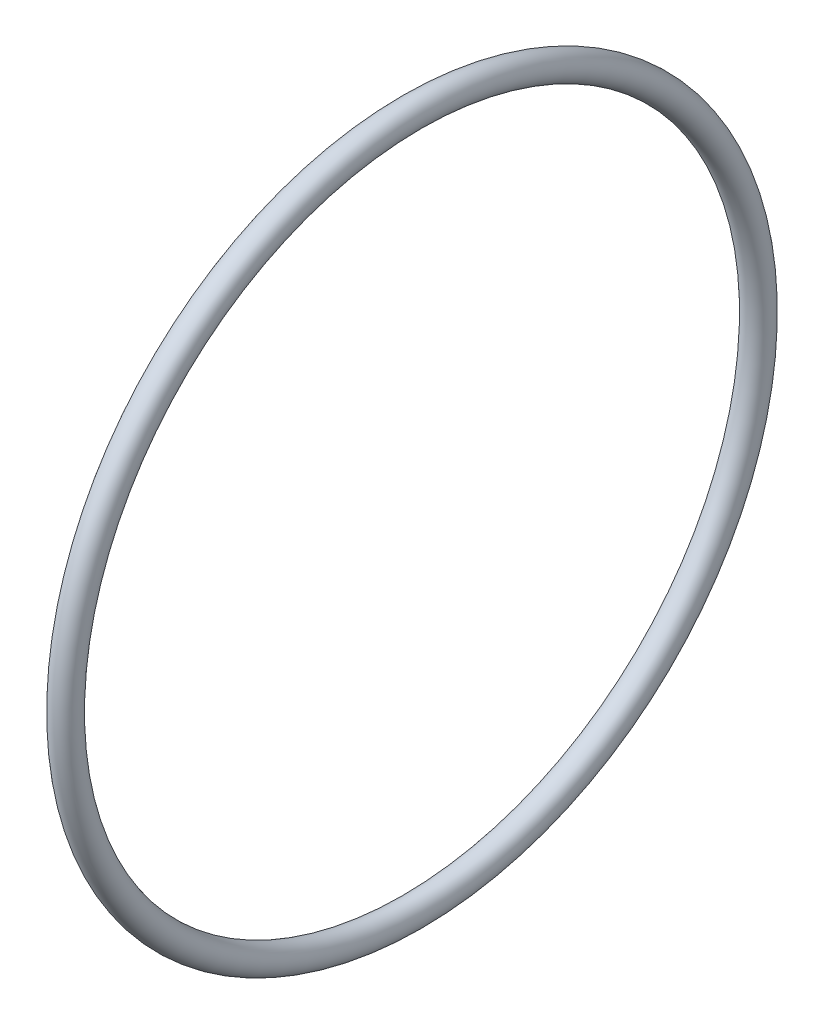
ISO-10303-21;
HEADER;
FILE_DESCRIPTION(('STEP AP214'),'2;1');
FILE_NAME('part.step','',(''),(''),'','','');
FILE_SCHEMA(('AUTOMOTIVE_DESIGN { 1 0 10303 214 1 1 1 1 }'));
ENDSEC;
DATA;
#1=APPLICATION_CONTEXT('core data for automotive mechanical design processes');
#2=APPLICATION_PROTOCOL_DEFINITION('international standard','automotive_design',2000,#1);
#3=PRODUCT_CONTEXT('',#1,'mechanical');
#4=PRODUCT('Part','Part','',(#3));
#5=PRODUCT_RELATED_PRODUCT_CATEGORY('part','',(#4));
#6=PRODUCT_DEFINITION_FORMATION('','',#4);
#7=PRODUCT_DEFINITION_CONTEXT('part definition',#1,'design');
#8=PRODUCT_DEFINITION('design','',#6,#7);
#9=PRODUCT_DEFINITION_SHAPE('','',#8);
#10=(LENGTH_UNIT() NAMED_UNIT(*) SI_UNIT(.MILLI.,.METRE.));
#11=(NAMED_UNIT(*) PLANE_ANGLE_UNIT() SI_UNIT($,.RADIAN.));
#12=(NAMED_UNIT(*) SI_UNIT($,.STERADIAN.) SOLID_ANGLE_UNIT());
#13=UNCERTAINTY_MEASURE_WITH_UNIT(LENGTH_MEASURE(1.E-05),#10,'distance_accuracy_value','');
#14=(GEOMETRIC_REPRESENTATION_CONTEXT(3) GLOBAL_UNCERTAINTY_ASSIGNED_CONTEXT((#13)) GLOBAL_UNIT_ASSIGNED_CONTEXT((#10,
#11,#12)) REPRESENTATION_CONTEXT('',''));
#15=CARTESIAN_POINT('',(0.,0.,0.));
#16=DIRECTION('',(0.,0.,1.));
#17=DIRECTION('',(1.,0.,0.));
#18=AXIS2_PLACEMENT_3D('',#15,#16,#17);
#19=CARTESIAN_POINT('',(-2.276002,0.,0.));
#20=DIRECTION('',(1.,0.,0.));
#21=DIRECTION('',(0.,1.,0.));
#22=AXIS2_PLACEMENT_3D('',#19,#20,#21);
#23=TOROIDAL_SURFACE('',#22,16.166665,0.625);
#24=ADVANCED_FACE('F12',(),#23,.T.);
#25=CLOSED_SHELL('',(#24));
#26=CARTESIAN_POINT('',(-2.276002,0.,0.));
#27=DIRECTION('',(1.,0.,0.));
#28=DIRECTION('',(0.,1.,0.));
#29=AXIS2_PLACEMENT_3D('',#26,#27,#28);
#30=TOROIDAL_SURFACE('',#29,16.166665,0.3125);
#31=ADVANCED_FACE('F30',(),#30,.F.);
#32=CLOSED_SHELL('',(#31));
#33=ORIENTED_CLOSED_SHELL('',*,#32,.T.);
#34=BREP_WITH_VOIDS('B1',#25,(#33));
#35=ADVANCED_BREP_SHAPE_REPRESENTATION('',(#18,#34),#14);
#36=SHAPE_DEFINITION_REPRESENTATION(#9,#35);
ENDSEC;
END-ISO-10303-21;
